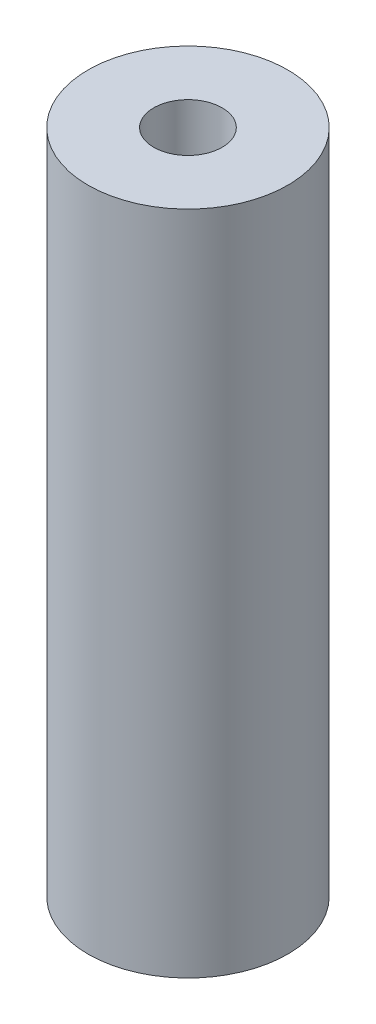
from build123d import *

# Parameters (mm, degrees)
SKETCH1_R           = 9.525
SKETCH1_R_2         = 3.2639
BOSS_EXTRUDE1_DEPTH = 63.5


with BuildPart() as part:
    # Sketch1 → Boss-Extrude1 (new body)
    with BuildSketch(Plane(origin=(0, 0, 0), x_dir=(1, 0, 0), z_dir=(0, 1, 0))):
        with Locations(Location((0, 0, 0), (0, 0, 270))):
            Circle(SKETCH1_R)
        with Locations(Location((0, 0, 0), (0, 0, 270))):
            Circle(SKETCH1_R_2, mode=Mode.SUBTRACT)
    extrude(amount=BOSS_EXTRUDE1_DEPTH)


solid = part.part
